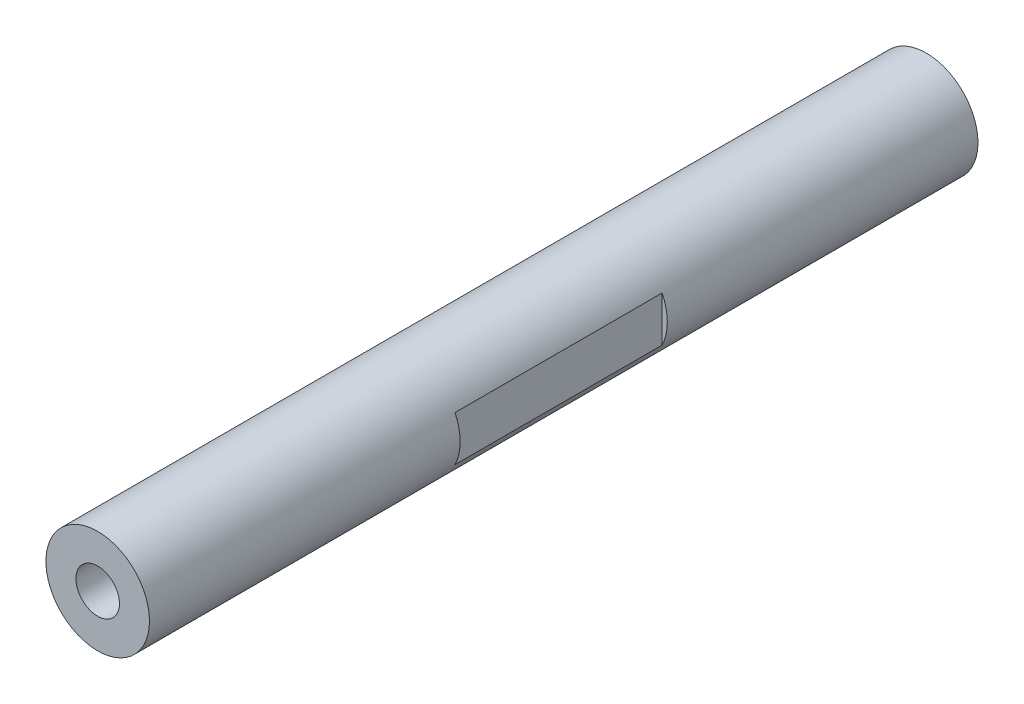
ISO-10303-21;
HEADER;
FILE_DESCRIPTION(('STEP AP214'),'2;1');
FILE_NAME('part.step','',(''),(''),'','','');
FILE_SCHEMA(('AUTOMOTIVE_DESIGN { 1 0 10303 214 1 1 1 1 }'));
ENDSEC;
DATA;
#1=APPLICATION_CONTEXT('core data for automotive mechanical design processes');
#2=APPLICATION_PROTOCOL_DEFINITION('international standard','automotive_design',2000,#1);
#3=PRODUCT_CONTEXT('',#1,'mechanical');
#4=PRODUCT('Part','Part','',(#3));
#5=PRODUCT_RELATED_PRODUCT_CATEGORY('part','',(#4));
#6=PRODUCT_DEFINITION_FORMATION('','',#4);
#7=PRODUCT_DEFINITION_CONTEXT('part definition',#1,'design');
#8=PRODUCT_DEFINITION('design','',#6,#7);
#9=PRODUCT_DEFINITION_SHAPE('','',#8);
#10=(LENGTH_UNIT() NAMED_UNIT(*) SI_UNIT(.MILLI.,.METRE.));
#11=(NAMED_UNIT(*) PLANE_ANGLE_UNIT() SI_UNIT($,.RADIAN.));
#12=(NAMED_UNIT(*) SI_UNIT($,.STERADIAN.) SOLID_ANGLE_UNIT());
#13=UNCERTAINTY_MEASURE_WITH_UNIT(LENGTH_MEASURE(1.E-05),#10,'distance_accuracy_value','');
#14=(GEOMETRIC_REPRESENTATION_CONTEXT(3) GLOBAL_UNCERTAINTY_ASSIGNED_CONTEXT((#13)) GLOBAL_UNIT_ASSIGNED_CONTEXT((#10,
#11,#12)) REPRESENTATION_CONTEXT('',''));
#15=CARTESIAN_POINT('',(0.,0.,0.));
#16=DIRECTION('',(0.,0.,1.));
#17=DIRECTION('',(1.,0.,0.));
#18=AXIS2_PLACEMENT_3D('',#15,#16,#17);
#19=CARTESIAN_POINT('',(0.,0.,80.));
#20=DIRECTION('',(0.,0.,-1.));
#21=DIRECTION('',(-1.,0.,0.));
#22=AXIS2_PLACEMENT_3D('',#19,#20,#21);
#23=CYLINDRICAL_SURFACE('',#22,5.);
#24=CARTESIAN_POINT('',(0.,0.,50.));
#25=DIRECTION('',(0.,0.,-1.));
#26=DIRECTION('',(-1.,0.,0.));
#27=AXIS2_PLACEMENT_3D('',#24,#25,#26);
#28=CIRCLE('',#27,5.);
#29=CARTESIAN_POINT('',(-4.5,-2.17944947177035,50.));
#30=VERTEX_POINT('',#29);
#31=CARTESIAN_POINT('',(-4.5,2.17944947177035,50.));
#32=VERTEX_POINT('',#31);
#33=EDGE_CURVE('E100',#30,#32,#28,.T.);
#34=ORIENTED_EDGE('',*,*,#33,.F.);
#35=DIRECTION('',(0.,0.,-1.));
#36=VECTOR('',#35,1.);
#37=CARTESIAN_POINT('',(-4.5,-2.17944947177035,80.));
#38=LINE('',#37,#36);
#39=CARTESIAN_POINT('',(-4.5,-2.17944947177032,30.));
#40=VERTEX_POINT('',#39);
#41=EDGE_CURVE('E96',#40,#30,#38,.F.);
#42=ORIENTED_EDGE('',*,*,#41,.F.);
#43=CARTESIAN_POINT('',(0.,0.,30.));
#44=DIRECTION('',(0.,0.,1.));
#45=DIRECTION('',(1.,0.,0.));
#46=AXIS2_PLACEMENT_3D('',#43,#44,#45);
#47=CIRCLE('',#46,5.);
#48=CARTESIAN_POINT('',(-4.5,2.17944947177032,30.));
#49=VERTEX_POINT('',#48);
#50=EDGE_CURVE('E92',#49,#40,#47,.T.);
#51=ORIENTED_EDGE('',*,*,#50,.F.);
#52=DIRECTION('',(0.,0.,-1.));
#53=VECTOR('',#52,1.);
#54=CARTESIAN_POINT('',(-4.5,2.17944947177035,80.));
#55=LINE('',#54,#53);
#56=EDGE_CURVE('E98',#32,#49,#55,.T.);
#57=ORIENTED_EDGE('',*,*,#56,.F.);
#58=EDGE_LOOP('',(#34,#42,#51,#57));
#59=FACE_BOUND('',#58,.T.);
#60=CARTESIAN_POINT('',(0.,0.,80.));
#61=DIRECTION('',(0.,0.,1.));
#62=DIRECTION('',(1.,0.,0.));
#63=AXIS2_PLACEMENT_3D('',#60,#61,#62);
#64=CIRCLE('',#63,5.);
#65=CARTESIAN_POINT('',(5.,0.,80.));
#66=VERTEX_POINT('',#65);
#67=EDGE_CURVE('E89',#66,#66,#64,.T.);
#68=ORIENTED_EDGE('',*,*,#67,.F.);
#69=EDGE_LOOP('',(#68));
#70=FACE_BOUND('',#69,.T.);
#71=CARTESIAN_POINT('',(0.,0.,0.));
#72=DIRECTION('',(0.,0.,1.));
#73=DIRECTION('',(1.,0.,0.));
#74=AXIS2_PLACEMENT_3D('',#71,#72,#73);
#75=CIRCLE('',#74,5.);
#76=CARTESIAN_POINT('',(5.,0.,0.));
#77=VERTEX_POINT('',#76);
#78=EDGE_CURVE('E88',#77,#77,#75,.T.);
#79=ORIENTED_EDGE('',*,*,#78,.T.);
#80=EDGE_LOOP('',(#79));
#81=FACE_BOUND('',#80,.T.);
#82=CARTESIAN_POINT('',(0.,0.,50.));
#83=DIRECTION('',(0.,0.,-1.));
#84=DIRECTION('',(-1.,0.,0.));
#85=AXIS2_PLACEMENT_3D('',#82,#83,#84);
#86=CIRCLE('',#85,5.);
#87=CARTESIAN_POINT('',(4.5,2.17944947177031,50.));
#88=VERTEX_POINT('',#87);
#89=CARTESIAN_POINT('',(4.5,-2.17944947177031,50.));
#90=VERTEX_POINT('',#89);
#91=EDGE_CURVE('E11',#88,#90,#86,.T.);
#92=ORIENTED_EDGE('',*,*,#91,.F.);
#93=DIRECTION('',(0.,0.,-1.));
#94=VECTOR('',#93,1.);
#95=CARTESIAN_POINT('',(4.5,2.17944947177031,80.));
#96=LINE('',#95,#94);
#97=CARTESIAN_POINT('',(4.5,2.17944947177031,30.));
#98=VERTEX_POINT('',#97);
#99=EDGE_CURVE('E104',#98,#88,#96,.F.);
#100=ORIENTED_EDGE('',*,*,#99,.F.);
#101=CARTESIAN_POINT('',(0.,0.,30.));
#102=DIRECTION('',(0.,0.,1.));
#103=DIRECTION('',(1.,0.,0.));
#104=AXIS2_PLACEMENT_3D('',#101,#102,#103);
#105=CIRCLE('',#104,5.);
#106=CARTESIAN_POINT('',(4.5,-2.17944947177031,30.));
#107=VERTEX_POINT('',#106);
#108=EDGE_CURVE('E102',#107,#98,#105,.T.);
#109=ORIENTED_EDGE('',*,*,#108,.F.);
#110=DIRECTION('',(0.,0.,-1.));
#111=VECTOR('',#110,1.);
#112=CARTESIAN_POINT('',(4.5,-2.17944947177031,80.));
#113=LINE('',#112,#111);
#114=EDGE_CURVE('E23',#90,#107,#113,.T.);
#115=ORIENTED_EDGE('',*,*,#114,.F.);
#116=EDGE_LOOP('',(#92,#100,#109,#115));
#117=FACE_BOUND('',#116,.T.);
#118=ADVANCED_FACE('F16',(#59,#70,#81,#117),#23,.T.);
#119=CARTESIAN_POINT('',(0.,0.,80.));
#120=DIRECTION('',(0.,0.,1.));
#121=DIRECTION('',(1.,0.,0.));
#122=AXIS2_PLACEMENT_3D('',#119,#120,#121);
#123=PLANE('',#122);
#124=CARTESIAN_POINT('',(0.,0.,80.));
#125=DIRECTION('',(0.,0.,1.));
#126=DIRECTION('',(1.,0.,0.));
#127=AXIS2_PLACEMENT_3D('',#124,#125,#126);
#128=CIRCLE('',#127,2.1);
#129=CARTESIAN_POINT('',(2.1,0.,80.));
#130=VERTEX_POINT('',#129);
#131=EDGE_CURVE('E70',#130,#130,#128,.T.);
#132=ORIENTED_EDGE('',*,*,#131,.F.);
#133=EDGE_LOOP('',(#132));
#134=FACE_BOUND('',#133,.T.);
#135=ORIENTED_EDGE('',*,*,#67,.T.);
#136=EDGE_LOOP('',(#135));
#137=FACE_BOUND('',#136,.T.);
#138=ADVANCED_FACE('F129',(#134,#137),#123,.T.);
#139=CARTESIAN_POINT('',(0.,0.,0.));
#140=DIRECTION('',(0.,0.,1.));
#141=DIRECTION('',(1.,0.,0.));
#142=AXIS2_PLACEMENT_3D('',#139,#140,#141);
#143=PLANE('',#142);
#144=CARTESIAN_POINT('',(0.,0.,0.));
#145=DIRECTION('',(0.,0.,-1.));
#146=DIRECTION('',(-1.,0.,0.));
#147=AXIS2_PLACEMENT_3D('',#144,#145,#146);
#148=CIRCLE('',#147,2.1);
#149=CARTESIAN_POINT('',(-2.1,0.,0.));
#150=VERTEX_POINT('',#149);
#151=EDGE_CURVE('E69',#150,#150,#148,.T.);
#152=ORIENTED_EDGE('',*,*,#151,.F.);
#153=EDGE_LOOP('',(#152));
#154=FACE_BOUND('',#153,.T.);
#155=ORIENTED_EDGE('',*,*,#78,.F.);
#156=EDGE_LOOP('',(#155));
#157=FACE_BOUND('',#156,.T.);
#158=ADVANCED_FACE('F135',(#154,#157),#143,.F.);
#159=CARTESIAN_POINT('',(-4.5,50.,50.));
#160=DIRECTION('',(0.,0.,-1.));
#161=DIRECTION('',(-1.,0.,0.));
#162=AXIS2_PLACEMENT_3D('',#159,#160,#161);
#163=PLANE('',#162);
#164=ORIENTED_EDGE('',*,*,#33,.T.);
#165=DIRECTION('',(0.,-1.,0.));
#166=VECTOR('',#165,1.);
#167=CARTESIAN_POINT('',(-4.5,50.,50.));
#168=LINE('',#167,#166);
#169=EDGE_CURVE('E85',#32,#30,#168,.T.);
#170=ORIENTED_EDGE('',*,*,#169,.T.);
#171=EDGE_LOOP('',(#164,#170));
#172=FACE_BOUND('',#171,.T.);
#173=ADVANCED_FACE('F147',(#172),#163,.T.);
#174=CARTESIAN_POINT('',(-4.5,50.,30.));
#175=DIRECTION('',(-1.,0.,0.));
#176=DIRECTION('',(0.,0.,1.));
#177=AXIS2_PLACEMENT_3D('',#174,#175,#176);
#178=PLANE('',#177);
#179=ORIENTED_EDGE('',*,*,#56,.T.);
#180=DIRECTION('',(0.,-1.,0.));
#181=VECTOR('',#180,1.);
#182=CARTESIAN_POINT('',(-4.5,50.,30.));
#183=LINE('',#182,#181);
#184=EDGE_CURVE('E36',#49,#40,#183,.T.);
#185=ORIENTED_EDGE('',*,*,#184,.T.);
#186=ORIENTED_EDGE('',*,*,#41,.T.);
#187=ORIENTED_EDGE('',*,*,#169,.F.);
#188=EDGE_LOOP('',(#179,#185,#186,#187));
#189=FACE_BOUND('',#188,.T.);
#190=ADVANCED_FACE('F153',(#189),#178,.T.);
#191=CARTESIAN_POINT('',(-4.5,50.,30.));
#192=DIRECTION('',(0.,0.,1.));
#193=DIRECTION('',(1.,0.,0.));
#194=AXIS2_PLACEMENT_3D('',#191,#192,#193);
#195=PLANE('',#194);
#196=ORIENTED_EDGE('',*,*,#50,.T.);
#197=ORIENTED_EDGE('',*,*,#184,.F.);
#198=EDGE_LOOP('',(#196,#197));
#199=FACE_BOUND('',#198,.T.);
#200=ADVANCED_FACE('F160',(#199),#195,.T.);
#201=CARTESIAN_POINT('',(4.5,50.,30.));
#202=DIRECTION('',(1.,0.,0.));
#203=DIRECTION('',(0.,0.,-1.));
#204=AXIS2_PLACEMENT_3D('',#201,#202,#203);
#205=PLANE('',#204);
#206=ORIENTED_EDGE('',*,*,#114,.T.);
#207=DIRECTION('',(0.,-1.,0.));
#208=VECTOR('',#207,1.);
#209=CARTESIAN_POINT('',(4.5,50.,30.));
#210=LINE('',#209,#208);
#211=EDGE_CURVE('E29',#98,#107,#210,.T.);
#212=ORIENTED_EDGE('',*,*,#211,.F.);
#213=ORIENTED_EDGE('',*,*,#99,.T.);
#214=DIRECTION('',(0.,-1.,0.));
#215=VECTOR('',#214,1.);
#216=CARTESIAN_POINT('',(4.5,50.,50.));
#217=LINE('',#216,#215);
#218=EDGE_CURVE('E81',#88,#90,#217,.T.);
#219=ORIENTED_EDGE('',*,*,#218,.T.);
#220=EDGE_LOOP('',(#206,#212,#213,#219));
#221=FACE_BOUND('',#220,.T.);
#222=ADVANCED_FACE('F108',(#221),#205,.T.);
#223=CARTESIAN_POINT('',(4.5,50.,50.));
#224=DIRECTION('',(0.,0.,-1.));
#225=DIRECTION('',(-1.,0.,0.));
#226=AXIS2_PLACEMENT_3D('',#223,#224,#225);
#227=PLANE('',#226);
#228=ORIENTED_EDGE('',*,*,#91,.T.);
#229=ORIENTED_EDGE('',*,*,#218,.F.);
#230=EDGE_LOOP('',(#228,#229));
#231=FACE_BOUND('',#230,.T.);
#232=ADVANCED_FACE('F116',(#231),#227,.T.);
#233=CARTESIAN_POINT('',(4.5,50.,30.));
#234=DIRECTION('',(0.,0.,1.));
#235=DIRECTION('',(1.,0.,0.));
#236=AXIS2_PLACEMENT_3D('',#233,#234,#235);
#237=PLANE('',#236);
#238=ORIENTED_EDGE('',*,*,#108,.T.);
#239=ORIENTED_EDGE('',*,*,#211,.T.);
#240=EDGE_LOOP('',(#238,#239));
#241=FACE_BOUND('',#240,.T.);
#242=ADVANCED_FACE('F113',(#241),#237,.T.);
#243=CARTESIAN_POINT('',(0.,0.,12.4));
#244=DIRECTION('',(0.,0.,-1.));
#245=DIRECTION('',(-1.,0.,0.));
#246=AXIS2_PLACEMENT_3D('',#243,#244,#245);
#247=CONICAL_SURFACE('',#246,2.1,1.02974425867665);
#248=CARTESIAN_POINT('',(0.,0.,13.6618072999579));
#249=VERTEX_POINT('',#248);
#250=VERTEX_LOOP('',#249);
#251=FACE_BOUND('',#250,.T.);
#252=CARTESIAN_POINT('',(0.,0.,12.4));
#253=DIRECTION('',(0.,0.,-1.));
#254=DIRECTION('',(-1.,0.,0.));
#255=AXIS2_PLACEMENT_3D('',#252,#253,#254);
#256=CIRCLE('',#255,2.1);
#257=CARTESIAN_POINT('',(-2.1,0.,12.4));
#258=VERTEX_POINT('',#257);
#259=EDGE_CURVE('E73',#258,#258,#256,.T.);
#260=ORIENTED_EDGE('',*,*,#259,.T.);
#261=EDGE_LOOP('',(#260));
#262=FACE_BOUND('',#261,.T.);
#263=ADVANCED_FACE('F115',(#251,#262),#247,.F.);
#264=CARTESIAN_POINT('',(0.,0.,0.));
#265=DIRECTION('',(0.,0.,-1.));
#266=DIRECTION('',(-1.,0.,0.));
#267=AXIS2_PLACEMENT_3D('',#264,#265,#266);
#268=CYLINDRICAL_SURFACE('',#267,2.1);
#269=ORIENTED_EDGE('',*,*,#259,.F.);
#270=EDGE_LOOP('',(#269));
#271=FACE_BOUND('',#270,.T.);
#272=ORIENTED_EDGE('',*,*,#151,.T.);
#273=EDGE_LOOP('',(#272));
#274=FACE_BOUND('',#273,.T.);
#275=ADVANCED_FACE('F63',(#271,#274),#268,.F.);
#276=CARTESIAN_POINT('',(0.,0.,67.6));
#277=DIRECTION('',(0.,0.,1.));
#278=DIRECTION('',(1.,0.,0.));
#279=AXIS2_PLACEMENT_3D('',#276,#277,#278);
#280=CONICAL_SURFACE('',#279,2.1,1.02974425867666);
#281=CARTESIAN_POINT('',(0.,0.,66.3381927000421));
#282=VERTEX_POINT('',#281);
#283=VERTEX_LOOP('',#282);
#284=FACE_BOUND('',#283,.T.);
#285=CARTESIAN_POINT('',(0.,0.,67.6));
#286=DIRECTION('',(0.,0.,1.));
#287=DIRECTION('',(1.,0.,0.));
#288=AXIS2_PLACEMENT_3D('',#285,#286,#287);
#289=CIRCLE('',#288,2.1);
#290=CARTESIAN_POINT('',(2.1,0.,67.6));
#291=VERTEX_POINT('',#290);
#292=EDGE_CURVE('E67',#291,#291,#289,.T.);
#293=ORIENTED_EDGE('',*,*,#292,.T.);
#294=EDGE_LOOP('',(#293));
#295=FACE_BOUND('',#294,.T.);
#296=ADVANCED_FACE('F59',(#284,#295),#280,.F.);
#297=CARTESIAN_POINT('',(0.,0.,80.));
#298=DIRECTION('',(0.,0.,1.));
#299=DIRECTION('',(1.,0.,0.));
#300=AXIS2_PLACEMENT_3D('',#297,#298,#299);
#301=CYLINDRICAL_SURFACE('',#300,2.1);
#302=ORIENTED_EDGE('',*,*,#292,.F.);
#303=EDGE_LOOP('',(#302));
#304=FACE_BOUND('',#303,.T.);
#305=ORIENTED_EDGE('',*,*,#131,.T.);
#306=EDGE_LOOP('',(#305));
#307=FACE_BOUND('',#306,.T.);
#308=ADVANCED_FACE('F62',(#304,#307),#301,.F.);
#309=CLOSED_SHELL('',(#118,#138,#158,#173,#190,#200,#222,#232,#242,#263,#275,#296,#308));
#310=MANIFOLD_SOLID_BREP('B1',#309);
#311=ADVANCED_BREP_SHAPE_REPRESENTATION('',(#18,#310),#14);
#312=SHAPE_DEFINITION_REPRESENTATION(#9,#311);
ENDSEC;
END-ISO-10303-21;
